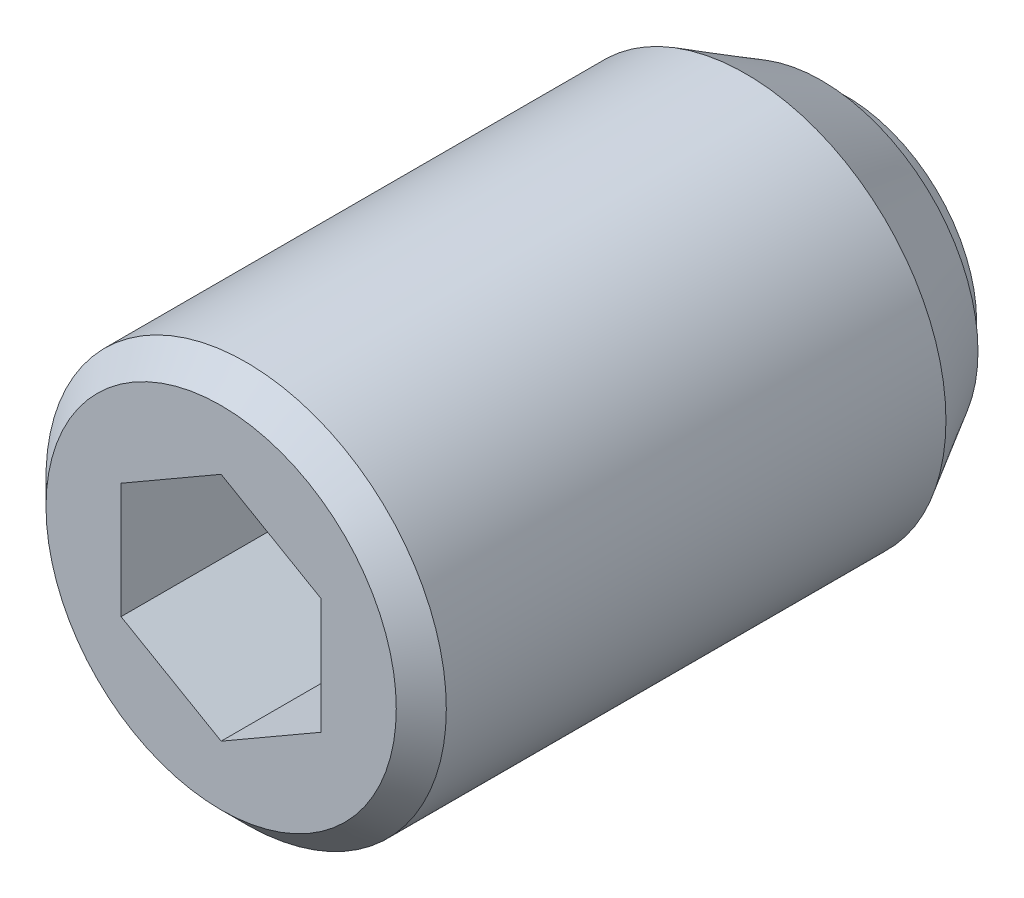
ISO-10303-21;
HEADER;
FILE_DESCRIPTION(('STEP AP214'),'2;1');
FILE_NAME('part.step','',(''),(''),'','','');
FILE_SCHEMA(('AUTOMOTIVE_DESIGN { 1 0 10303 214 1 1 1 1 }'));
ENDSEC;
DATA;
#1=APPLICATION_CONTEXT('core data for automotive mechanical design processes');
#2=APPLICATION_PROTOCOL_DEFINITION('international standard','automotive_design',2000,#1);
#3=PRODUCT_CONTEXT('',#1,'mechanical');
#4=PRODUCT('Part','Part','',(#3));
#5=PRODUCT_RELATED_PRODUCT_CATEGORY('part','',(#4));
#6=PRODUCT_DEFINITION_FORMATION('','',#4);
#7=PRODUCT_DEFINITION_CONTEXT('part definition',#1,'design');
#8=PRODUCT_DEFINITION('design','',#6,#7);
#9=PRODUCT_DEFINITION_SHAPE('','',#8);
#10=(LENGTH_UNIT() NAMED_UNIT(*) SI_UNIT(.MILLI.,.METRE.));
#11=(NAMED_UNIT(*) PLANE_ANGLE_UNIT() SI_UNIT($,.RADIAN.));
#12=(NAMED_UNIT(*) SI_UNIT($,.STERADIAN.) SOLID_ANGLE_UNIT());
#13=UNCERTAINTY_MEASURE_WITH_UNIT(LENGTH_MEASURE(1.E-05),#10,'distance_accuracy_value','');
#14=(GEOMETRIC_REPRESENTATION_CONTEXT(3) GLOBAL_UNCERTAINTY_ASSIGNED_CONTEXT((#13)) GLOBAL_UNIT_ASSIGNED_CONTEXT((#10,
#11,#12)) REPRESENTATION_CONTEXT('',''));
#15=CARTESIAN_POINT('',(0.,0.,0.));
#16=DIRECTION('',(0.,0.,1.));
#17=DIRECTION('',(1.,0.,0.));
#18=AXIS2_PLACEMENT_3D('',#15,#16,#17);
#19=CARTESIAN_POINT('',(4.,2.30940107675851,22.5));
#20=DIRECTION('',(0.5,0.86602540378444,0.));
#21=DIRECTION('',(0.86602540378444,-0.5,0.));
#22=AXIS2_PLACEMENT_3D('',#19,#20,#21);
#23=PLANE('',#22);
#24=DIRECTION('',(0.,0.,1.));
#25=VECTOR('',#24,1.);
#26=CARTESIAN_POINT('',(4.,2.30940107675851,22.5));
#27=LINE('',#26,#25);
#28=CARTESIAN_POINT('',(4.,2.30940107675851,19.));
#29=VERTEX_POINT('',#28);
#30=CARTESIAN_POINT('',(4.,2.30940107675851,25.));
#31=VERTEX_POINT('',#30);
#32=EDGE_CURVE('E68',#29,#31,#27,.T.);
#33=ORIENTED_EDGE('',*,*,#32,.T.);
#34=DIRECTION('',(-0.86602540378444,0.5,0.));
#35=VECTOR('',#34,1.);
#36=CARTESIAN_POINT('',(4.,2.30940107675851,25.));
#37=LINE('',#36,#35);
#38=CARTESIAN_POINT('',(0.,4.618802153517,25.));
#39=VERTEX_POINT('',#38);
#40=EDGE_CURVE('E29',#31,#39,#37,.T.);
#41=ORIENTED_EDGE('',*,*,#40,.T.);
#42=DIRECTION('',(0.,0.,1.));
#43=VECTOR('',#42,1.);
#44=CARTESIAN_POINT('',(0.,4.618802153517,22.5));
#45=LINE('',#44,#43);
#46=CARTESIAN_POINT('',(0.,4.618802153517,19.));
#47=VERTEX_POINT('',#46);
#48=EDGE_CURVE('E80',#47,#39,#45,.T.);
#49=ORIENTED_EDGE('',*,*,#48,.F.);
#50=DIRECTION('',(-0.86602540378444,0.5,0.));
#51=VECTOR('',#50,1.);
#52=CARTESIAN_POINT('',(4.,2.30940107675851,19.));
#53=LINE('',#52,#51);
#54=EDGE_CURVE('E79',#29,#47,#53,.T.);
#55=ORIENTED_EDGE('',*,*,#54,.F.);
#56=EDGE_LOOP('',(#33,#41,#49,#55));
#57=FACE_BOUND('',#56,.T.);
#58=ADVANCED_FACE('F14',(#57),#23,.F.);
#59=CARTESIAN_POINT('',(4.,-2.30940107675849,22.5));
#60=DIRECTION('',(1.,0.,0.));
#61=DIRECTION('',(0.,-1.,0.));
#62=AXIS2_PLACEMENT_3D('',#59,#60,#61);
#63=PLANE('',#62);
#64=DIRECTION('',(0.,0.,1.));
#65=VECTOR('',#64,1.);
#66=CARTESIAN_POINT('',(4.,-2.30940107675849,22.5));
#67=LINE('',#66,#65);
#68=CARTESIAN_POINT('',(4.,-2.30940107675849,19.));
#69=VERTEX_POINT('',#68);
#70=CARTESIAN_POINT('',(4.,-2.30940107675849,25.));
#71=VERTEX_POINT('',#70);
#72=EDGE_CURVE('E76',#69,#71,#67,.T.);
#73=ORIENTED_EDGE('',*,*,#72,.T.);
#74=DIRECTION('',(0.,1.,0.));
#75=VECTOR('',#74,1.);
#76=CARTESIAN_POINT('',(4.,-2.30940107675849,25.));
#77=LINE('',#76,#75);
#78=EDGE_CURVE('E75',#71,#31,#77,.T.);
#79=ORIENTED_EDGE('',*,*,#78,.T.);
#80=ORIENTED_EDGE('',*,*,#32,.F.);
#81=DIRECTION('',(0.,1.,0.));
#82=VECTOR('',#81,1.);
#83=CARTESIAN_POINT('',(4.,-2.30940107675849,19.));
#84=LINE('',#83,#82);
#85=EDGE_CURVE('E72',#69,#29,#84,.T.);
#86=ORIENTED_EDGE('',*,*,#85,.F.);
#87=EDGE_LOOP('',(#73,#79,#80,#86));
#88=FACE_BOUND('',#87,.T.);
#89=ADVANCED_FACE('F70',(#88),#63,.F.);
#90=CARTESIAN_POINT('',(4.,-2.30940107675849,22.5));
#91=DIRECTION('',(-0.5,0.866025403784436,0.));
#92=DIRECTION('',(0.866025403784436,0.5,0.));
#93=AXIS2_PLACEMENT_3D('',#90,#91,#92);
#94=PLANE('',#93);
#95=DIRECTION('',(0.,0.,1.));
#96=VECTOR('',#95,1.);
#97=CARTESIAN_POINT('',(0.,-4.61880215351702,22.5));
#98=LINE('',#97,#96);
#99=CARTESIAN_POINT('',(0.,-4.61880215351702,19.));
#100=VERTEX_POINT('',#99);
#101=CARTESIAN_POINT('',(0.,-4.61880215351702,25.));
#102=VERTEX_POINT('',#101);
#103=EDGE_CURVE('E122',#100,#102,#98,.T.);
#104=ORIENTED_EDGE('',*,*,#103,.T.);
#105=DIRECTION('',(-0.866025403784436,-0.5,0.));
#106=VECTOR('',#105,1.);
#107=CARTESIAN_POINT('',(4.,-2.30940107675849,25.));
#108=LINE('',#107,#106);
#109=EDGE_CURVE('E113',#71,#102,#108,.T.);
#110=ORIENTED_EDGE('',*,*,#109,.F.);
#111=ORIENTED_EDGE('',*,*,#72,.F.);
#112=DIRECTION('',(0.866025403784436,0.5,0.));
#113=VECTOR('',#112,1.);
#114=CARTESIAN_POINT('',(0.,-4.61880215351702,19.));
#115=LINE('',#114,#113);
#116=EDGE_CURVE('E89',#100,#69,#115,.T.);
#117=ORIENTED_EDGE('',*,*,#116,.F.);
#118=EDGE_LOOP('',(#104,#110,#111,#117));
#119=FACE_BOUND('',#118,.T.);
#120=ADVANCED_FACE('F147',(#119),#94,.T.);
#121=CARTESIAN_POINT('',(-4.,-2.30940107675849,22.5));
#122=DIRECTION('',(-0.5,-0.866025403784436,0.));
#123=DIRECTION('',(-0.866025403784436,0.5,0.));
#124=AXIS2_PLACEMENT_3D('',#121,#122,#123);
#125=PLANE('',#124);
#126=DIRECTION('',(0.,0.,1.));
#127=VECTOR('',#126,1.);
#128=CARTESIAN_POINT('',(-4.,-2.30940107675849,22.5));
#129=LINE('',#128,#127);
#130=CARTESIAN_POINT('',(-4.,-2.30940107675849,19.));
#131=VERTEX_POINT('',#130);
#132=CARTESIAN_POINT('',(-4.,-2.30940107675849,25.));
#133=VERTEX_POINT('',#132);
#134=EDGE_CURVE('E120',#131,#133,#129,.T.);
#135=ORIENTED_EDGE('',*,*,#134,.T.);
#136=DIRECTION('',(0.866025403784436,-0.5,0.));
#137=VECTOR('',#136,1.);
#138=CARTESIAN_POINT('',(-4.,-2.30940107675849,25.));
#139=LINE('',#138,#137);
#140=EDGE_CURVE('E111',#133,#102,#139,.T.);
#141=ORIENTED_EDGE('',*,*,#140,.T.);
#142=ORIENTED_EDGE('',*,*,#103,.F.);
#143=DIRECTION('',(0.866025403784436,-0.5,0.));
#144=VECTOR('',#143,1.);
#145=CARTESIAN_POINT('',(-4.,-2.30940107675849,19.));
#146=LINE('',#145,#144);
#147=EDGE_CURVE('E101',#131,#100,#146,.T.);
#148=ORIENTED_EDGE('',*,*,#147,.F.);
#149=EDGE_LOOP('',(#135,#141,#142,#148));
#150=FACE_BOUND('',#149,.T.);
#151=ADVANCED_FACE('F157',(#150),#125,.F.);
#152=CARTESIAN_POINT('',(-4.,-2.30940107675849,22.5));
#153=DIRECTION('',(1.,0.,0.));
#154=DIRECTION('',(0.,-1.,0.));
#155=AXIS2_PLACEMENT_3D('',#152,#153,#154);
#156=PLANE('',#155);
#157=DIRECTION('',(0.,0.,1.));
#158=VECTOR('',#157,1.);
#159=CARTESIAN_POINT('',(-4.,2.30940107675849,22.5));
#160=LINE('',#159,#158);
#161=CARTESIAN_POINT('',(-4.,2.30940107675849,19.));
#162=VERTEX_POINT('',#161);
#163=CARTESIAN_POINT('',(-4.,2.30940107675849,25.));
#164=VERTEX_POINT('',#163);
#165=EDGE_CURVE('E37',#162,#164,#160,.T.);
#166=ORIENTED_EDGE('',*,*,#165,.T.);
#167=DIRECTION('',(0.,1.,0.));
#168=VECTOR('',#167,1.);
#169=CARTESIAN_POINT('',(-4.,-2.30940107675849,25.));
#170=LINE('',#169,#168);
#171=EDGE_CURVE('E108',#133,#164,#170,.T.);
#172=ORIENTED_EDGE('',*,*,#171,.F.);
#173=ORIENTED_EDGE('',*,*,#134,.F.);
#174=DIRECTION('',(0.,-1.,0.));
#175=VECTOR('',#174,1.);
#176=CARTESIAN_POINT('',(-4.,2.30940107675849,19.));
#177=LINE('',#176,#175);
#178=EDGE_CURVE('E98',#162,#131,#177,.T.);
#179=ORIENTED_EDGE('',*,*,#178,.F.);
#180=EDGE_LOOP('',(#166,#172,#173,#179));
#181=FACE_BOUND('',#180,.T.);
#182=ADVANCED_FACE('F153',(#181),#156,.T.);
#183=CARTESIAN_POINT('',(-4.,2.30940107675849,22.5));
#184=DIRECTION('',(0.5,-0.866025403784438,0.));
#185=DIRECTION('',(-0.866025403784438,-0.5,0.));
#186=AXIS2_PLACEMENT_3D('',#183,#184,#185);
#187=PLANE('',#186);
#188=ORIENTED_EDGE('',*,*,#165,.F.);
#189=DIRECTION('',(-0.866025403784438,-0.5,0.));
#190=VECTOR('',#189,1.);
#191=CARTESIAN_POINT('',(0.,4.618802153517,19.));
#192=LINE('',#191,#190);
#193=EDGE_CURVE('E84',#47,#162,#192,.T.);
#194=ORIENTED_EDGE('',*,*,#193,.F.);
#195=ORIENTED_EDGE('',*,*,#48,.T.);
#196=DIRECTION('',(0.866025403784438,0.5,0.));
#197=VECTOR('',#196,1.);
#198=CARTESIAN_POINT('',(-4.,2.30940107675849,25.));
#199=LINE('',#198,#197);
#200=EDGE_CURVE('E105',#164,#39,#199,.T.);
#201=ORIENTED_EDGE('',*,*,#200,.F.);
#202=EDGE_LOOP('',(#188,#194,#195,#201));
#203=FACE_BOUND('',#202,.T.);
#204=ADVANCED_FACE('F150',(#203),#187,.T.);
#205=CARTESIAN_POINT('',(0.,0.,24.75));
#206=DIRECTION('',(0.,0.,-1.));
#207=DIRECTION('',(1.,0.,0.));
#208=AXIS2_PLACEMENT_3D('',#205,#206,#207);
#209=CYLINDRICAL_SURFACE('',#208,8.);
#210=CARTESIAN_POINT('',(0.,0.,24.));
#211=DIRECTION('',(0.,0.,-1.));
#212=DIRECTION('',(1.,0.,0.));
#213=AXIS2_PLACEMENT_3D('',#210,#211,#212);
#214=CIRCLE('',#213,8.);
#215=CARTESIAN_POINT('',(8.,0.,24.));
#216=VERTEX_POINT('',#215);
#217=EDGE_CURVE('E9',#216,#216,#214,.T.);
#218=ORIENTED_EDGE('',*,*,#217,.T.);
#219=EDGE_LOOP('',(#218));
#220=FACE_BOUND('',#219,.T.);
#221=CARTESIAN_POINT('',(0.,0.,4.03108891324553));
#222=DIRECTION('',(0.,0.,-1.));
#223=DIRECTION('',(-1.,0.,0.));
#224=AXIS2_PLACEMENT_3D('',#221,#222,#223);
#225=CIRCLE('',#224,8.);
#226=CARTESIAN_POINT('',(-8.,0.,4.03108891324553));
#227=VERTEX_POINT('',#226);
#228=EDGE_CURVE('E260',#227,#227,#225,.T.);
#229=ORIENTED_EDGE('',*,*,#228,.F.);
#230=EDGE_LOOP('',(#229));
#231=FACE_BOUND('',#230,.T.);
#232=ADVANCED_FACE('F16',(#220,#231),#209,.T.);
#233=CARTESIAN_POINT('',(0.,0.,24.));
#234=DIRECTION('',(0.,0.,-1.));
#235=DIRECTION('',(1.,0.,0.));
#236=AXIS2_PLACEMENT_3D('',#233,#234,#235);
#237=CONICAL_SURFACE('',#236,8.,0.785398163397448);
#238=CARTESIAN_POINT('',(0.,0.,25.));
#239=DIRECTION('',(0.,0.,-1.));
#240=DIRECTION('',(1.,0.,0.));
#241=AXIS2_PLACEMENT_3D('',#238,#239,#240);
#242=CIRCLE('',#241,7.);
#243=CARTESIAN_POINT('',(7.,0.,25.));
#244=VERTEX_POINT('',#243);
#245=EDGE_CURVE('E22',#244,#244,#242,.T.);
#246=ORIENTED_EDGE('',*,*,#245,.T.);
#247=EDGE_LOOP('',(#246));
#248=FACE_BOUND('',#247,.T.);
#249=ORIENTED_EDGE('',*,*,#217,.F.);
#250=EDGE_LOOP('',(#249));
#251=FACE_BOUND('',#250,.T.);
#252=ADVANCED_FACE('F127',(#248,#251),#237,.T.);
#253=CARTESIAN_POINT('',(0.,0.,25.));
#254=DIRECTION('',(0.,0.,-1.));
#255=DIRECTION('',(1.,0.,0.));
#256=AXIS2_PLACEMENT_3D('',#253,#254,#255);
#257=PLANE('',#256);
#258=ORIENTED_EDGE('',*,*,#200,.T.);
#259=ORIENTED_EDGE('',*,*,#40,.F.);
#260=ORIENTED_EDGE('',*,*,#78,.F.);
#261=ORIENTED_EDGE('',*,*,#109,.T.);
#262=ORIENTED_EDGE('',*,*,#140,.F.);
#263=ORIENTED_EDGE('',*,*,#171,.T.);
#264=EDGE_LOOP('',(#258,#259,#260,#261,#262,#263));
#265=FACE_BOUND('',#264,.T.);
#266=ORIENTED_EDGE('',*,*,#245,.F.);
#267=EDGE_LOOP('',(#266));
#268=FACE_BOUND('',#267,.T.);
#269=ADVANCED_FACE('F130',(#265,#268),#257,.F.);
#270=CARTESIAN_POINT('',(4.,2.30940107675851,19.));
#271=DIRECTION('',(0.,0.,1.));
#272=DIRECTION('',(1.,0.,0.));
#273=AXIS2_PLACEMENT_3D('',#270,#271,#272);
#274=PLANE('',#273);
#275=ORIENTED_EDGE('',*,*,#85,.T.);
#276=ORIENTED_EDGE('',*,*,#54,.T.);
#277=ORIENTED_EDGE('',*,*,#193,.T.);
#278=ORIENTED_EDGE('',*,*,#178,.T.);
#279=ORIENTED_EDGE('',*,*,#147,.T.);
#280=ORIENTED_EDGE('',*,*,#116,.T.);
#281=EDGE_LOOP('',(#275,#276,#277,#278,#279,#280));
#282=FACE_BOUND('',#281,.T.);
#283=ADVANCED_FACE('F86',(#282),#274,.T.);
#284=CARTESIAN_POINT('',(0.,0.,0.));
#285=DIRECTION('',(0.,0.,-1.));
#286=DIRECTION('',(-1.,0.,0.));
#287=AXIS2_PLACEMENT_3D('',#284,#285,#286);
#288=PLANE('',#287);
#289=CARTESIAN_POINT('',(0.,0.,0.));
#290=DIRECTION('',(0.,0.,-1.));
#291=DIRECTION('',(-1.,0.,0.));
#292=AXIS2_PLACEMENT_3D('',#289,#290,#291);
#293=CIRCLE('',#292,5.19615242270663);
#294=CARTESIAN_POINT('',(-5.19615242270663,0.,0.));
#295=VERTEX_POINT('',#294);
#296=EDGE_CURVE('E90',#295,#295,#293,.T.);
#297=ORIENTED_EDGE('',*,*,#296,.T.);
#298=EDGE_LOOP('',(#297));
#299=FACE_BOUND('',#298,.T.);
#300=ADVANCED_FACE('F139',(#299),#288,.T.);
#301=CARTESIAN_POINT('',(0.,0.,3.));
#302=DIRECTION('',(0.,0.,-1.));
#303=DIRECTION('',(-1.,0.,0.));
#304=AXIS2_PLACEMENT_3D('',#301,#302,#303);
#305=SPHERICAL_SURFACE('',#304,6.);
#306=CARTESIAN_POINT('',(0.,0.,1.));
#307=DIRECTION('',(0.,0.,-1.));
#308=DIRECTION('',(-1.,0.,0.));
#309=AXIS2_PLACEMENT_3D('',#306,#307,#308);
#310=CIRCLE('',#309,5.65685424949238);
#311=CARTESIAN_POINT('',(-5.65685424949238,0.,1.));
#312=VERTEX_POINT('',#311);
#313=EDGE_CURVE('E93',#312,#312,#310,.T.);
#314=CARTESIAN_POINT('',(-5.65685424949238,0.,1.));
#315=CARTESIAN_POINT('',(-5.65302587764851,0.,0.989171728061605));
#316=CARTESIAN_POINT('',(-5.64916641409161,0.,0.978354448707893));
#317=CARTESIAN_POINT('',(-5.64138543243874,0.,0.956742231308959));
#318=CARTESIAN_POINT('',(-5.63746391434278,0.,0.945947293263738));
#319=CARTESIAN_POINT('',(-5.62955895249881,0.,0.924380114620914));
#320=CARTESIAN_POINT('',(-5.62557550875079,0.,0.913607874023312));
#321=CARTESIAN_POINT('',(-5.61754682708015,0.,0.892086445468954));
#322=CARTESIAN_POINT('',(-5.61350158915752,0.,0.881337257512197));
#323=CARTESIAN_POINT('',(-5.60534945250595,0.,0.859862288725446));
#324=CARTESIAN_POINT('',(-5.60124255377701,0.,0.849136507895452));
#325=CARTESIAN_POINT('',(-5.59296723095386,0.,0.827708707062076));
#326=CARTESIAN_POINT('',(-5.58879880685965,0.,0.817006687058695));
#327=CARTESIAN_POINT('',(-5.58040057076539,0.,0.795626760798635));
#328=CARTESIAN_POINT('',(-5.57617075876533,0.,0.784948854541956));
#329=CARTESIAN_POINT('',(-5.56764988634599,0.,0.763617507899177));
#330=CARTESIAN_POINT('',(-5.56335882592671,0.,0.752964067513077));
#331=CARTESIAN_POINT('',(-5.55471559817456,0.,0.731682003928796));
#332=CARTESIAN_POINT('',(-5.55036343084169,0.,0.721053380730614));
#333=CARTESIAN_POINT('',(-5.54159813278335,0.,0.699821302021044));
#334=CARTESIAN_POINT('',(-5.53718500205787,0.,0.689217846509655));
#335=CARTESIAN_POINT('',(-5.52829792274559,0.,0.668036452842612));
#336=CARTESIAN_POINT('',(-5.52382397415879,0.,0.657458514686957));
#337=CARTESIAN_POINT('',(-5.51481540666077,0.,0.636328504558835));
#338=CARTESIAN_POINT('',(-5.51028078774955,0.,0.625776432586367));
#339=CARTESIAN_POINT('',(-5.50115102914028,0.,0.604698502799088));
#340=CARTESIAN_POINT('',(-5.49655588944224,0.,0.594172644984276));
#341=CARTESIAN_POINT('',(-5.48730524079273,0.,0.573147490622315));
#342=CARTESIAN_POINT('',(-5.48264973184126,0.,0.562648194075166));
#343=CARTESIAN_POINT('',(-5.47327849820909,0.,0.541676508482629));
#344=CARTESIAN_POINT('',(-5.46856277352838,0.,0.531204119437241));
#345=CARTESIAN_POINT('',(-5.45907126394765,0.,0.510286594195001));
#346=CARTESIAN_POINT('',(-5.45429547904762,0.,0.499841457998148));
#347=CARTESIAN_POINT('',(-5.44468400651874,0.,0.478978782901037));
#348=CARTESIAN_POINT('',(-5.43984831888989,0.,0.468561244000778));
#349=CARTESIAN_POINT('',(-5.4301172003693,0.,0.447754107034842));
#350=CARTESIAN_POINT('',(-5.42522176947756,0.,0.437364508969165));
#351=CARTESIAN_POINT('',(-5.41537132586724,0.,0.416613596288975));
#352=CARTESIAN_POINT('',(-5.41041631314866,0.,0.406252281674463));
#353=CARTESIAN_POINT('',(-5.40044686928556,0.,0.385558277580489));
#354=CARTESIAN_POINT('',(-5.39543243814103,0.,0.375225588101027));
#355=CARTESIAN_POINT('',(-5.38534432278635,0.,0.354589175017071));
#356=CARTESIAN_POINT('',(-5.3802706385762,0.,0.344285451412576));
#357=CARTESIAN_POINT('',(-5.37006418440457,0.,0.323707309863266));
#358=CARTESIAN_POINT('',(-5.3649314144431,0.,0.313432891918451));
#359=CARTESIAN_POINT('',(-5.35460695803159,0.,0.292913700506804));
#360=CARTESIAN_POINT('',(-5.34941527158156,0.,0.282668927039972));
#361=CARTESIAN_POINT('',(-5.33897315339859,0.,0.262209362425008));
#362=CARTESIAN_POINT('',(-5.33372272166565,0.,0.251994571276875));
#363=CARTESIAN_POINT('',(-5.32316328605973,0.,0.231595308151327));
#364=CARTESIAN_POINT('',(-5.31785428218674,0.,0.221410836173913));
#365=CARTESIAN_POINT('',(-5.30717787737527,0.,0.201072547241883));
#366=CARTESIAN_POINT('',(-5.30181047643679,0.,0.190918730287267));
#367=CARTESIAN_POINT('',(-5.29101745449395,0.,0.170642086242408));
#368=CARTESIAN_POINT('',(-5.28559183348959,0.,0.160519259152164));
#369=CARTESIAN_POINT('',(-5.27468255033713,0.,0.140304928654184));
#370=CARTESIAN_POINT('',(-5.26919888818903,0.,0.130213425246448));
#371=CARTESIAN_POINT('',(-5.25817370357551,0.,0.110062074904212));
#372=CARTESIAN_POINT('',(-5.25263218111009,0.,0.100002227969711));
#373=CARTESIAN_POINT('',(-5.24149145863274,0.,0.0799145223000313));
#374=CARTESIAN_POINT('',(-5.23589225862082,0.,0.0698866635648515));
#375=CARTESIAN_POINT('',(-5.22463636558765,0.,0.0498632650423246));
#376=CARTESIAN_POINT('',(-5.21897967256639,0.,0.0398677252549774));
#377=CARTESIAN_POINT('',(-5.20760898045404,0.,0.019909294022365));
#378=CARTESIAN_POINT('',(-5.20189498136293,0.,0.0099464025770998));
#379=CARTESIAN_POINT('',(-5.19615242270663,0.,0.));
#380=B_SPLINE_CURVE_WITH_KNOTS('',3,(#314,#315,#316,#317,#318,#319,#320,#321,#322,#323,#324,
#325,#326,#327,#328,#329,#330,#331,#332,#333,#334,#335,#336,#337,#338,#339,#340,#341,#342,#343,
#344,#345,#346,#347,#348,#349,#350,#351,#352,#353,#354,#355,#356,#357,#358,#359,#360,#361,#362,
#363,#364,#365,#366,#367,#368,#369,#370,#371,#372,#373,#374,#375,#376,#377,#378,#379),
.UNSPECIFIED.,.F.,.F.,(4,2,2,2,2,2,2,2,2,2,2,2,2,2,2,2,2,2,2,2,2,2,2,2,2,2,2,2,2,2,2,2,4),(0.,
0.0344553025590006,0.0689106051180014,0.103365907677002,0.137821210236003,0.172276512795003,
0.206731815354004,0.241187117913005,0.275642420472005,0.310097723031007,0.344553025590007,
0.379008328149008,0.413463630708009,0.44791893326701,0.48237423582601,0.516829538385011,
0.551284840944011,0.585740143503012,0.620195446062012,0.654650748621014,0.689106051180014,
0.723561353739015,0.758016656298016,0.792471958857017,0.826927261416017,0.861382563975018,
0.895837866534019,0.930293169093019,0.96474847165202,0.99920377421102,1.03365907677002,
1.06811437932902,1.10256968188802),.UNSPECIFIED.);
#381=EDGE_CURVE('BSEAM223',#312,#295,#380,.T.);
#382=ORIENTED_EDGE('',*,*,#313,.T.);
#383=ORIENTED_EDGE('',*,*,#296,.F.);
#384=ORIENTED_EDGE('',*,*,#381,.T.);
#385=ORIENTED_EDGE('',*,*,#381,.F.);
#386=EDGE_LOOP('',(#382,#384,#383,#385));
#387=FACE_BOUND('',#386,.T.);
#388=ADVANCED_FACE('F223',(#387),#305,.T.);
#389=CARTESIAN_POINT('',(-5.65685424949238,0.,1.));
#390=DIRECTION('',(0.,0.,-1.));
#391=DIRECTION('',(-1.,0.,0.));
#392=AXIS2_PLACEMENT_3D('',#389,#390,#391);
#393=PLANE('',#392);
#394=CARTESIAN_POINT('',(0.,0.,1.));
#395=DIRECTION('',(0.,0.,-1.));
#396=DIRECTION('',(-1.,0.,0.));
#397=AXIS2_PLACEMENT_3D('',#394,#395,#396);
#398=CIRCLE('',#397,6.25);
#399=CARTESIAN_POINT('',(-6.25,0.,1.));
#400=VERTEX_POINT('',#399);
#401=EDGE_CURVE('E263',#400,#400,#398,.T.);
#402=ORIENTED_EDGE('',*,*,#401,.T.);
#403=EDGE_LOOP('',(#402));
#404=FACE_BOUND('',#403,.T.);
#405=ORIENTED_EDGE('',*,*,#313,.F.);
#406=EDGE_LOOP('',(#405));
#407=FACE_BOUND('',#406,.T.);
#408=ADVANCED_FACE('F232',(#404,#407),#393,.T.);
#409=CARTESIAN_POINT('',(0.,0.,1.));
#410=DIRECTION('',(0.,0.,1.));
#411=DIRECTION('',(1.,0.,0.));
#412=AXIS2_PLACEMENT_3D('',#409,#410,#411);
#413=CONICAL_SURFACE('',#412,6.25,0.523598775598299);
#414=ORIENTED_EDGE('',*,*,#228,.T.);
#415=EDGE_LOOP('',(#414));
#416=FACE_BOUND('',#415,.T.);
#417=ORIENTED_EDGE('',*,*,#401,.F.);
#418=EDGE_LOOP('',(#417));
#419=FACE_BOUND('',#418,.T.);
#420=ADVANCED_FACE('F242',(#416,#419),#413,.T.);
#421=CLOSED_SHELL('',(#58,#89,#120,#151,#182,#204,#232,#252,#269,#283,#300,#388,#408,#420));
#422=MANIFOLD_SOLID_BREP('B1',#421);
#423=ADVANCED_BREP_SHAPE_REPRESENTATION('',(#18,#422),#14);
#424=SHAPE_DEFINITION_REPRESENTATION(#9,#423);
ENDSEC;
END-ISO-10303-21;
